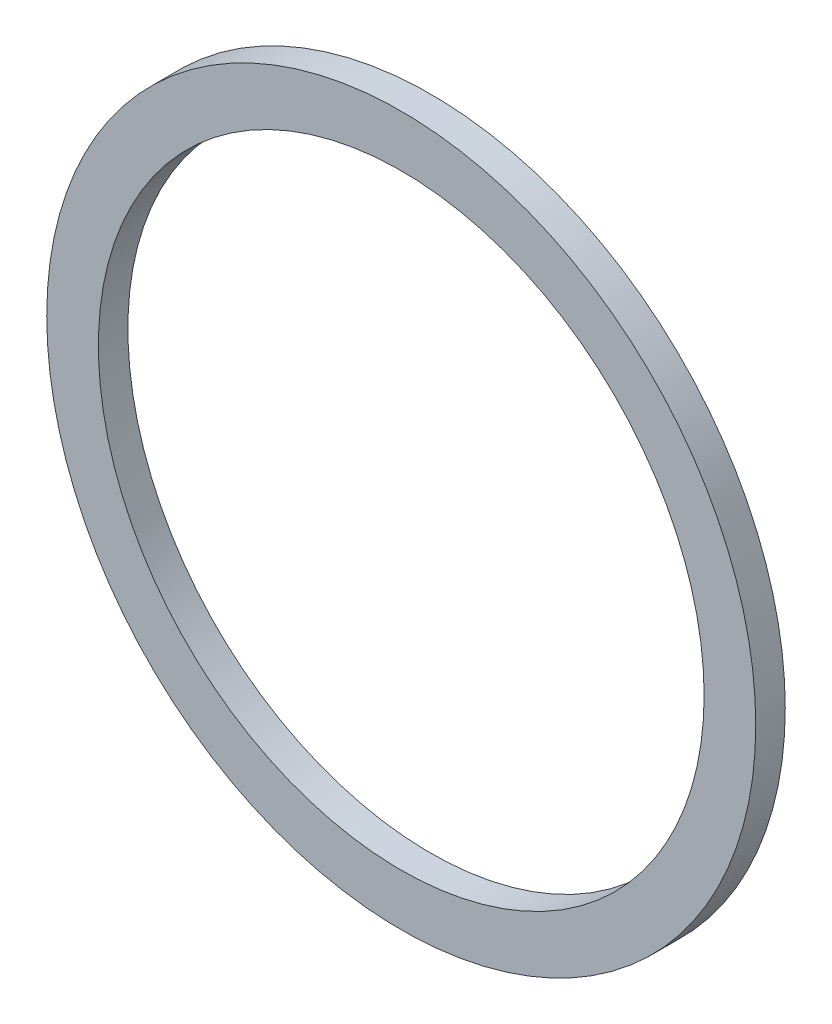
from build123d import *

# Parameters (mm, degrees)
SKETCH1_R           = 19.225
SKETCH1_R_2         = 16.425
BOSS_EXTRUDE1_DEPTH = 1.6


with BuildPart() as part:
    # Sketch1 → Boss-Extrude1 (new body)
    with BuildSketch(Plane.XY):
        Circle(SKETCH1_R)
        Circle(SKETCH1_R_2, mode=Mode.SUBTRACT)
    extrude(amount=BOSS_EXTRUDE1_DEPTH)


solid = part.part
